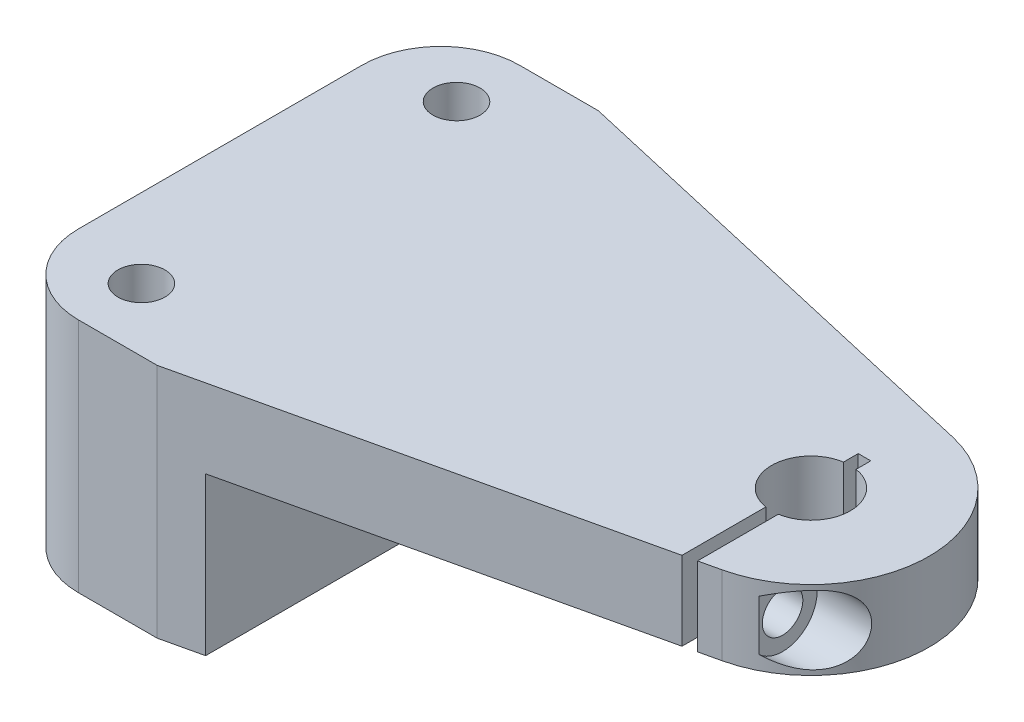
ISO-10303-21;
HEADER;
FILE_DESCRIPTION(('STEP AP214'),'2;1');
FILE_NAME('part.step','',(''),(''),'','','');
FILE_SCHEMA(('AUTOMOTIVE_DESIGN { 1 0 10303 214 1 1 1 1 }'));
ENDSEC;
DATA;
#1=APPLICATION_CONTEXT('core data for automotive mechanical design processes');
#2=APPLICATION_PROTOCOL_DEFINITION('international standard','automotive_design',2000,#1);
#3=PRODUCT_CONTEXT('',#1,'mechanical');
#4=PRODUCT('Part','Part','',(#3));
#5=PRODUCT_RELATED_PRODUCT_CATEGORY('part','',(#4));
#6=PRODUCT_DEFINITION_FORMATION('','',#4);
#7=PRODUCT_DEFINITION_CONTEXT('part definition',#1,'design');
#8=PRODUCT_DEFINITION('design','',#6,#7);
#9=PRODUCT_DEFINITION_SHAPE('','',#8);
#10=(LENGTH_UNIT() NAMED_UNIT(*) SI_UNIT(.MILLI.,.METRE.));
#11=(NAMED_UNIT(*) PLANE_ANGLE_UNIT() SI_UNIT($,.RADIAN.));
#12=(NAMED_UNIT(*) SI_UNIT($,.STERADIAN.) SOLID_ANGLE_UNIT());
#13=UNCERTAINTY_MEASURE_WITH_UNIT(LENGTH_MEASURE(1.E-05),#10,'distance_accuracy_value','');
#14=(GEOMETRIC_REPRESENTATION_CONTEXT(3) GLOBAL_UNCERTAINTY_ASSIGNED_CONTEXT((#13)) GLOBAL_UNIT_ASSIGNED_CONTEXT((#10,
#11,#12)) REPRESENTATION_CONTEXT('',''));
#15=CARTESIAN_POINT('',(0.,0.,0.));
#16=DIRECTION('',(0.,0.,1.));
#17=DIRECTION('',(1.,0.,0.));
#18=AXIS2_PLACEMENT_3D('',#15,#16,#17);
#19=CARTESIAN_POINT('',(2.12871499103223,19.05,9.28408301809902));
#20=DIRECTION('',(-0.223487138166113,0.,-0.97470687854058));
#21=DIRECTION('',(-0.97470687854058,0.,0.223487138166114));
#22=AXIS2_PLACEMENT_3D('',#19,#20,#21);
#23=PLANE('',#22);
#24=DIRECTION('',(0.97470687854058,0.,-0.223487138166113));
#25=VECTOR('',#24,1.);
#26=CARTESIAN_POINT('',(2.12871499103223,19.05,9.28408301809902));
#27=LINE('',#26,#25);
#28=CARTESIAN_POINT('',(0.508,19.05,9.65569110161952));
#29=VERTEX_POINT('',#28);
#30=CARTESIAN_POINT('',(2.12871499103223,19.05,9.28408301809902));
#31=VERTEX_POINT('',#30);
#32=EDGE_CURVE('E247',#29,#31,#27,.T.);
#33=ORIENTED_EDGE('',*,*,#32,.F.);
#34=DIRECTION('',(0.,-1.,0.));
#35=VECTOR('',#34,1.);
#36=CARTESIAN_POINT('',(0.508,19.05,9.65569110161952));
#37=LINE('',#36,#35);
#38=CARTESIAN_POINT('',(0.508000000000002,12.7,9.65569110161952));
#39=VERTEX_POINT('',#38);
#40=EDGE_CURVE('E298',#29,#39,#37,.T.);
#41=ORIENTED_EDGE('',*,*,#40,.T.);
#42=DIRECTION('',(0.97470687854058,0.,-0.223487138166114));
#43=VECTOR('',#42,1.);
#44=CARTESIAN_POINT('',(2.12871499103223,12.7,9.28408301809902));
#45=LINE('',#44,#43);
#46=CARTESIAN_POINT('',(2.12871499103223,12.7,9.28408301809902));
#47=VERTEX_POINT('',#46);
#48=EDGE_CURVE('E265',#39,#47,#45,.T.);
#49=ORIENTED_EDGE('',*,*,#48,.T.);
#50=DIRECTION('',(0.,-1.,0.));
#51=VECTOR('',#50,1.);
#52=CARTESIAN_POINT('',(2.12871499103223,19.05,9.28408301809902));
#53=LINE('',#52,#51);
#54=EDGE_CURVE('E251',#31,#47,#53,.T.);
#55=ORIENTED_EDGE('',*,*,#54,.F.);
#56=EDGE_LOOP('',(#33,#41,#49,#55));
#57=FACE_BOUND('',#56,.T.);
#58=ADVANCED_FACE('F32',(#57),#23,.F.);
#59=CARTESIAN_POINT('',(0.,19.05,0.));
#60=DIRECTION('',(0.,-1.,0.));
#61=DIRECTION('',(0.,0.,-1.));
#62=AXIS2_PLACEMENT_3D('',#59,#60,#61);
#63=CYLINDRICAL_SURFACE('',#62,3.175);
#64=DIRECTION('',(0.,-1.,0.));
#65=VECTOR('',#64,1.);
#66=CARTESIAN_POINT('',(0.508,19.05,3.13409652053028));
#67=LINE('',#66,#65);
#68=CARTESIAN_POINT('',(0.508,19.05,3.13409652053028));
#69=VERTEX_POINT('',#68);
#70=CARTESIAN_POINT('',(0.508000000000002,12.7,3.13409652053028));
#71=VERTEX_POINT('',#70);
#72=EDGE_CURVE('E291',#69,#71,#67,.T.);
#73=ORIENTED_EDGE('',*,*,#72,.F.);
#74=CARTESIAN_POINT('',(0.,19.05,0.));
#75=DIRECTION('',(0.,1.,0.));
#76=DIRECTION('',(0.,0.,1.));
#77=AXIS2_PLACEMENT_3D('',#74,#75,#76);
#78=CIRCLE('',#77,3.175);
#79=CARTESIAN_POINT('',(0.508,19.05,-3.13409652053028));
#80=VERTEX_POINT('',#79);
#81=EDGE_CURVE('E232',#69,#80,#78,.T.);
#82=ORIENTED_EDGE('',*,*,#81,.T.);
#83=DIRECTION('',(0.,-1.,0.));
#84=VECTOR('',#83,1.);
#85=CARTESIAN_POINT('',(0.508,19.05,-3.13409652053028));
#86=LINE('',#85,#84);
#87=CARTESIAN_POINT('',(0.508000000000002,12.7,-3.13409652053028));
#88=VERTEX_POINT('',#87);
#89=EDGE_CURVE('E293',#88,#80,#86,.F.);
#90=ORIENTED_EDGE('',*,*,#89,.F.);
#91=CARTESIAN_POINT('',(0.,12.7,0.));
#92=DIRECTION('',(0.,1.,0.));
#93=DIRECTION('',(0.,0.,1.));
#94=AXIS2_PLACEMENT_3D('',#91,#92,#93);
#95=CIRCLE('',#94,3.175);
#96=EDGE_CURVE('E262',#71,#88,#95,.T.);
#97=ORIENTED_EDGE('',*,*,#96,.F.);
#98=EDGE_LOOP('',(#73,#82,#90,#97));
#99=FACE_BOUND('',#98,.T.);
#100=ADVANCED_FACE('F289',(#99),#63,.F.);
#101=CARTESIAN_POINT('',(0.,19.05,0.));
#102=DIRECTION('',(0.,1.,0.));
#103=DIRECTION('',(0.,0.,1.));
#104=AXIS2_PLACEMENT_3D('',#101,#102,#103);
#105=PLANE('',#104);
#106=DIRECTION('',(-1.,0.,0.));
#107=VECTOR('',#106,1.);
#108=CARTESIAN_POINT('',(-47.625,19.05,-17.78));
#109=LINE('',#108,#107);
#110=CARTESIAN_POINT('',(-34.925,19.05,-17.78));
#111=VERTEX_POINT('',#110);
#112=CARTESIAN_POINT('',(-41.275,19.05,-17.78));
#113=VERTEX_POINT('',#112);
#114=EDGE_CURVE('E207',#111,#113,#109,.T.);
#115=ORIENTED_EDGE('',*,*,#114,.T.);
#116=CARTESIAN_POINT('',(-41.275,19.05,-11.43));
#117=DIRECTION('',(0.,1.,0.));
#118=DIRECTION('',(0.,0.,1.));
#119=AXIS2_PLACEMENT_3D('',#116,#117,#118);
#120=CIRCLE('',#119,6.35);
#121=CARTESIAN_POINT('',(-47.625,19.05,-11.43));
#122=VERTEX_POINT('',#121);
#123=EDGE_CURVE('E41',#113,#122,#120,.T.);
#124=ORIENTED_EDGE('',*,*,#123,.T.);
#125=DIRECTION('',(0.,0.,1.));
#126=VECTOR('',#125,1.);
#127=CARTESIAN_POINT('',(-47.625,19.05,-17.78));
#128=LINE('',#127,#126);
#129=CARTESIAN_POINT('',(-47.625,19.05,11.43));
#130=VERTEX_POINT('',#129);
#131=EDGE_CURVE('E206',#122,#130,#128,.T.);
#132=ORIENTED_EDGE('',*,*,#131,.T.);
#133=CARTESIAN_POINT('',(-41.275,19.05,11.43));
#134=DIRECTION('',(0.,1.,0.));
#135=DIRECTION('',(0.,0.,1.));
#136=AXIS2_PLACEMENT_3D('',#133,#134,#135);
#137=CIRCLE('',#136,6.35);
#138=CARTESIAN_POINT('',(-41.275,19.05,17.78));
#139=VERTEX_POINT('',#138);
#140=EDGE_CURVE('E48',#130,#139,#137,.T.);
#141=ORIENTED_EDGE('',*,*,#140,.T.);
#142=DIRECTION('',(1.,0.,0.));
#143=VECTOR('',#142,1.);
#144=CARTESIAN_POINT('',(-47.625,19.05,17.78));
#145=LINE('',#144,#143);
#146=CARTESIAN_POINT('',(-34.925,19.05,17.78));
#147=VERTEX_POINT('',#146);
#148=EDGE_CURVE('E215',#139,#147,#145,.T.);
#149=ORIENTED_EDGE('',*,*,#148,.T.);
#150=CARTESIAN_POINT('',(-0.508,19.05,9.88864619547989));
#151=VERTEX_POINT('',#150);
#152=EDGE_CURVE('E248',#147,#151,#27,.T.);
#153=ORIENTED_EDGE('',*,*,#152,.T.);
#154=DIRECTION('',(0.,0.,1.));
#155=VECTOR('',#154,1.);
#156=CARTESIAN_POINT('',(-0.508,19.05,-4.318));
#157=LINE('',#156,#155);
#158=CARTESIAN_POINT('',(-0.508,19.05,3.13409652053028));
#159=VERTEX_POINT('',#158);
#160=EDGE_CURVE('E348',#159,#151,#157,.T.);
#161=ORIENTED_EDGE('',*,*,#160,.F.);
#162=CARTESIAN_POINT('',(-0.508,19.05,-3.13409652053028));
#163=VERTEX_POINT('',#162);
#164=EDGE_CURVE('E334',#163,#159,#78,.T.);
#165=ORIENTED_EDGE('',*,*,#164,.F.);
#166=CARTESIAN_POINT('',(-0.508,19.05,-4.318));
#167=VERTEX_POINT('',#166);
#168=EDGE_CURVE('E347',#167,#163,#157,.T.);
#169=ORIENTED_EDGE('',*,*,#168,.F.);
#170=DIRECTION('',(-1.,0.,0.));
#171=VECTOR('',#170,1.);
#172=CARTESIAN_POINT('',(0.508,19.05,-4.318));
#173=LINE('',#172,#171);
#174=CARTESIAN_POINT('',(0.508,19.05,-4.318));
#175=VERTEX_POINT('',#174);
#176=EDGE_CURVE('E352',#175,#167,#173,.T.);
#177=ORIENTED_EDGE('',*,*,#176,.F.);
#178=DIRECTION('',(0.,0.,-1.));
#179=VECTOR('',#178,1.);
#180=CARTESIAN_POINT('',(0.508,19.05,-4.318));
#181=LINE('',#180,#179);
#182=EDGE_CURVE('E374',#80,#175,#181,.T.);
#183=ORIENTED_EDGE('',*,*,#182,.F.);
#184=ORIENTED_EDGE('',*,*,#81,.F.);
#185=EDGE_CURVE('E356',#29,#69,#181,.T.);
#186=ORIENTED_EDGE('',*,*,#185,.F.);
#187=ORIENTED_EDGE('',*,*,#32,.T.);
#188=CARTESIAN_POINT('',(0.,19.05,0.));
#189=DIRECTION('',(0.,1.,0.));
#190=DIRECTION('',(0.,0.,1.));
#191=AXIS2_PLACEMENT_3D('',#188,#189,#190);
#192=CIRCLE('',#191,9.525);
#193=CARTESIAN_POINT('',(2.12871499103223,19.05,-9.28408301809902));
#194=VERTEX_POINT('',#193);
#195=EDGE_CURVE('E240',#31,#194,#192,.T.);
#196=ORIENTED_EDGE('',*,*,#195,.T.);
#197=DIRECTION('',(-0.97470687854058,0.,-0.223487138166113));
#198=VECTOR('',#197,1.);
#199=CARTESIAN_POINT('',(-34.925,19.05,-17.78));
#200=LINE('',#199,#198);
#201=EDGE_CURVE('E243',#194,#111,#200,.T.);
#202=ORIENTED_EDGE('',*,*,#201,.T.);
#203=EDGE_LOOP('',(#115,#124,#132,#141,#149,#153,#161,#165,#169,#177,#183,#184,#186,#187,#196,#202));
#204=FACE_BOUND('',#203,.T.);
#205=CARTESIAN_POINT('',(-41.275,19.05,-12.7));
#206=DIRECTION('',(0.,1.,0.));
#207=DIRECTION('',(0.,0.,1.));
#208=AXIS2_PLACEMENT_3D('',#205,#206,#207);
#209=CIRCLE('',#208,1.89864999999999);
#210=CARTESIAN_POINT('',(-41.275,19.05,-10.80135));
#211=VERTEX_POINT('',#210);
#212=EDGE_CURVE('E326',#211,#211,#209,.T.);
#213=ORIENTED_EDGE('',*,*,#212,.F.);
#214=EDGE_LOOP('',(#213));
#215=FACE_BOUND('',#214,.T.);
#216=CARTESIAN_POINT('',(-41.275,19.05,12.7));
#217=DIRECTION('',(0.,1.,0.));
#218=DIRECTION('',(0.,0.,1.));
#219=AXIS2_PLACEMENT_3D('',#216,#217,#218);
#220=CIRCLE('',#219,1.89864999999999);
#221=CARTESIAN_POINT('',(-41.275,19.05,14.59865));
#222=VERTEX_POINT('',#221);
#223=EDGE_CURVE('E332',#222,#222,#220,.T.);
#224=ORIENTED_EDGE('',*,*,#223,.F.);
#225=EDGE_LOOP('',(#224));
#226=FACE_BOUND('',#225,.T.);
#227=ADVANCED_FACE('F204',(#204,#215,#226),#105,.T.);
#228=CARTESIAN_POINT('',(0.,0.,0.));
#229=DIRECTION('',(0.,1.,0.));
#230=DIRECTION('',(0.,0.,1.));
#231=AXIS2_PLACEMENT_3D('',#228,#229,#230);
#232=PLANE('',#231);
#233=CARTESIAN_POINT('',(-41.275,0.,-12.7));
#234=DIRECTION('',(0.,1.,0.));
#235=DIRECTION('',(0.,0.,1.));
#236=AXIS2_PLACEMENT_3D('',#233,#234,#235);
#237=CIRCLE('',#236,1.89864999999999);
#238=CARTESIAN_POINT('',(-41.275,0.,-10.80135));
#239=VERTEX_POINT('',#238);
#240=EDGE_CURVE('E323',#239,#239,#237,.T.);
#241=ORIENTED_EDGE('',*,*,#240,.T.);
#242=EDGE_LOOP('',(#241));
#243=FACE_BOUND('',#242,.T.);
#244=CARTESIAN_POINT('',(-41.275,0.,12.7));
#245=DIRECTION('',(0.,1.,0.));
#246=DIRECTION('',(0.,0.,1.));
#247=AXIS2_PLACEMENT_3D('',#244,#245,#246);
#248=CIRCLE('',#247,1.89864999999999);
#249=CARTESIAN_POINT('',(-41.275,0.,14.59865));
#250=VERTEX_POINT('',#249);
#251=EDGE_CURVE('E329',#250,#250,#248,.T.);
#252=ORIENTED_EDGE('',*,*,#251,.T.);
#253=EDGE_LOOP('',(#252));
#254=FACE_BOUND('',#253,.T.);
#255=DIRECTION('',(0.,0.,1.));
#256=VECTOR('',#255,1.);
#257=CARTESIAN_POINT('',(-47.625,0.,-17.78));
#258=LINE('',#257,#256);
#259=CARTESIAN_POINT('',(-47.625,0.,-11.43));
#260=VERTEX_POINT('',#259);
#261=CARTESIAN_POINT('',(-47.625,0.,11.43));
#262=VERTEX_POINT('',#261);
#263=EDGE_CURVE('E223',#260,#262,#258,.T.);
#264=ORIENTED_EDGE('',*,*,#263,.F.);
#265=CARTESIAN_POINT('',(-41.275,0.,-11.43));
#266=DIRECTION('',(0.,1.,0.));
#267=DIRECTION('',(0.,0.,1.));
#268=AXIS2_PLACEMENT_3D('',#265,#266,#267);
#269=CIRCLE('',#268,6.35);
#270=CARTESIAN_POINT('',(-41.275,0.,-17.78));
#271=VERTEX_POINT('',#270);
#272=EDGE_CURVE('E199',#260,#271,#269,.F.);
#273=ORIENTED_EDGE('',*,*,#272,.T.);
#274=DIRECTION('',(-1.,0.,0.));
#275=VECTOR('',#274,1.);
#276=CARTESIAN_POINT('',(-47.625,0.,-17.78));
#277=LINE('',#276,#275);
#278=CARTESIAN_POINT('',(-34.925,0.,-17.78));
#279=VERTEX_POINT('',#278);
#280=EDGE_CURVE('E222',#279,#271,#277,.T.);
#281=ORIENTED_EDGE('',*,*,#280,.F.);
#282=DIRECTION('',(-0.97470687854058,0.,-0.223487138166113));
#283=VECTOR('',#282,1.);
#284=CARTESIAN_POINT('',(-34.925,0.,-17.78));
#285=LINE('',#284,#283);
#286=CARTESIAN_POINT('',(-31.75,0.,-17.0520153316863));
#287=VERTEX_POINT('',#286);
#288=EDGE_CURVE('E228',#287,#279,#285,.T.);
#289=ORIENTED_EDGE('',*,*,#288,.F.);
#290=DIRECTION('',(0.,0.,1.));
#291=VECTOR('',#290,1.);
#292=CARTESIAN_POINT('',(-31.75,0.,0.));
#293=LINE('',#292,#291);
#294=CARTESIAN_POINT('',(-31.75,0.,17.0520153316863));
#295=VERTEX_POINT('',#294);
#296=EDGE_CURVE('E317',#287,#295,#293,.T.);
#297=ORIENTED_EDGE('',*,*,#296,.T.);
#298=DIRECTION('',(0.97470687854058,0.,-0.223487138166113));
#299=VECTOR('',#298,1.);
#300=CARTESIAN_POINT('',(2.12871499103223,0.,9.28408301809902));
#301=LINE('',#300,#299);
#302=CARTESIAN_POINT('',(-34.925,0.,17.78));
#303=VERTEX_POINT('',#302);
#304=EDGE_CURVE('E237',#303,#295,#301,.T.);
#305=ORIENTED_EDGE('',*,*,#304,.F.);
#306=DIRECTION('',(1.,0.,0.));
#307=VECTOR('',#306,1.);
#308=CARTESIAN_POINT('',(-47.625,0.,17.78));
#309=LINE('',#308,#307);
#310=CARTESIAN_POINT('',(-41.275,0.,17.78));
#311=VERTEX_POINT('',#310);
#312=EDGE_CURVE('E230',#311,#303,#309,.T.);
#313=ORIENTED_EDGE('',*,*,#312,.F.);
#314=CARTESIAN_POINT('',(-41.275,0.,11.43));
#315=DIRECTION('',(0.,1.,0.));
#316=DIRECTION('',(0.,0.,1.));
#317=AXIS2_PLACEMENT_3D('',#314,#315,#316);
#318=CIRCLE('',#317,6.35);
#319=EDGE_CURVE('E197',#311,#262,#318,.F.);
#320=ORIENTED_EDGE('',*,*,#319,.T.);
#321=EDGE_LOOP('',(#264,#273,#281,#289,#297,#305,#313,#320));
#322=FACE_BOUND('',#321,.T.);
#323=ADVANCED_FACE('F220',(#243,#254,#322),#232,.F.);
#324=CARTESIAN_POINT('',(0.,19.05,0.));
#325=DIRECTION('',(0.,-1.,0.));
#326=DIRECTION('',(0.,0.,-1.));
#327=AXIS2_PLACEMENT_3D('',#324,#325,#326);
#328=CYLINDRICAL_SURFACE('',#327,9.525);
#329=CARTESIAN_POINT('',(4.318,17.9156915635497,8.490023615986));
#330=CARTESIAN_POINT('',(4.40597686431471,17.9570382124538,8.44527816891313));
#331=CARTESIAN_POINT('',(4.49371232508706,17.9971478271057,8.3989353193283));
#332=CARTESIAN_POINT('',(4.66860369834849,18.074713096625,8.30299466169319));
#333=CARTESIAN_POINT('',(4.75575947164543,18.1121681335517,8.25339610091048));
#334=CARTESIAN_POINT('',(5.01676491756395,18.2205082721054,8.09929634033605));
#335=CARTESIAN_POINT('',(5.18952859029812,18.2870731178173,7.98980686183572));
#336=CARTESIAN_POINT('',(5.53321586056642,18.4072571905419,7.75583572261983));
#337=CARTESIAN_POINT('',(5.70407944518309,18.4606812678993,7.63116493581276));
#338=CARTESIAN_POINT('',(6.03965725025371,18.5501456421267,7.36840668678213));
#339=CARTESIAN_POINT('',(6.2043818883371,18.586216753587,7.23034353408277));
#340=CARTESIAN_POINT('',(6.45110709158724,18.6252458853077,7.00872650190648));
#341=CARTESIAN_POINT('',(6.53598098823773,18.6358021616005,6.92965311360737));
#342=CARTESIAN_POINT('',(6.70309201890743,18.650092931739,6.76813670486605));
#343=CARTESIAN_POINT('',(6.78532910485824,18.6538273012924,6.68569362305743));
#344=CARTESIAN_POINT('',(6.94639472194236,18.6536911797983,6.51817933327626));
#345=CARTESIAN_POINT('',(7.0252360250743,18.6498523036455,6.43312050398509));
#346=CARTESIAN_POINT('',(7.17936929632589,18.6338256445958,6.26064519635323));
#347=CARTESIAN_POINT('',(7.25466192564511,18.6216394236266,6.1732291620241));
#348=CARTESIAN_POINT('',(7.44913384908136,18.577101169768,5.93901227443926));
#349=CARTESIAN_POINT('',(7.56486081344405,18.5367767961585,5.79071301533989));
#350=CARTESIAN_POINT('',(7.78267131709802,18.4275181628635,5.49448780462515));
#351=CARTESIAN_POINT('',(7.88476160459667,18.3585981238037,5.34656170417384));
#352=CARTESIAN_POINT('',(8.05811069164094,18.203290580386,5.08071143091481));
#353=CARTESIAN_POINT('',(8.13169370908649,18.1213411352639,4.96172186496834));
#354=CARTESIAN_POINT('',(8.26632499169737,17.9356412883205,4.73402373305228));
#355=CARTESIAN_POINT('',(8.32737774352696,17.8318987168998,4.6253114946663));
#356=CARTESIAN_POINT('',(8.43655792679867,17.6036798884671,4.42305639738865));
#357=CARTESIAN_POINT('',(8.48462775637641,17.479115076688,4.32958184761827));
#358=CARTESIAN_POINT('',(8.56738981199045,17.2128036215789,4.16342685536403));
#359=CARTESIAN_POINT('',(8.60208446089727,17.0710600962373,4.0907426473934));
#360=CARTESIAN_POINT('',(8.65609960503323,16.7870856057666,3.97508706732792));
#361=CARTESIAN_POINT('',(8.67644215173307,16.6458346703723,3.93017778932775));
#362=CARTESIAN_POINT('',(8.70641234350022,16.3569128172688,3.8633367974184));
#363=CARTESIAN_POINT('',(8.7160426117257,16.2092434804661,3.84139945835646));
#364=CARTESIAN_POINT('',(8.72463834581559,15.917078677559,3.82183407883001));
#365=CARTESIAN_POINT('',(8.72395607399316,15.7726465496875,3.82340307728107));
#366=CARTESIAN_POINT('',(8.71276923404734,15.4861537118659,3.84882675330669));
#367=CARTESIAN_POINT('',(8.7022656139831,15.3440927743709,3.87267927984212));
#368=CARTESIAN_POINT('',(8.67131728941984,15.067051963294,3.94148205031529));
#369=CARTESIAN_POINT('',(8.65092064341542,14.9320413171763,3.98633026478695));
#370=CARTESIAN_POINT('',(8.59993560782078,14.6720533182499,4.09515837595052));
#371=CARTESIAN_POINT('',(8.56934753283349,14.5470756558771,4.15913768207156));
#372=CARTESIAN_POINT('',(8.49724863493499,14.3085481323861,4.30453739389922));
#373=CARTESIAN_POINT('',(8.45558465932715,14.195192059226,4.38619911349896));
#374=CARTESIAN_POINT('',(8.36158128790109,13.9844659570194,4.56284717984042));
#375=CARTESIAN_POINT('',(8.30924060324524,13.8870978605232,4.6578351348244));
#376=CARTESIAN_POINT('',(8.19133740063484,13.7052688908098,4.86232537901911));
#377=CARTESIAN_POINT('',(8.12523967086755,13.6217109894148,4.97231901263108));
#378=CARTESIAN_POINT('',(7.98250538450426,13.4741714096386,5.19837660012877));
#379=CARTESIAN_POINT('',(7.9058642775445,13.4101982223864,5.31444316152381));
#380=CARTESIAN_POINT('',(7.73369313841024,13.2947801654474,5.56245965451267));
#381=CARTESIAN_POINT('',(7.63700248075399,13.24567010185,5.69468186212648));
#382=CARTESIAN_POINT('',(7.43371841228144,13.168995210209,5.95760854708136));
#383=CARTESIAN_POINT('',(7.32712404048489,13.1414324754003,6.08831287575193));
#384=CARTESIAN_POINT('',(7.13014270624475,13.1092494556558,6.31698023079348));
#385=CARTESIAN_POINT('',(7.04133954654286,13.1009193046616,6.41582810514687));
#386=CARTESIAN_POINT('',(6.85946335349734,13.0945497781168,6.60992249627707));
#387=CARTESIAN_POINT('',(6.76638837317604,13.0965151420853,6.7051673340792));
#388=CARTESIAN_POINT('',(6.5761913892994,13.1095947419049,6.89182004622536));
#389=CARTESIAN_POINT('',(6.47905120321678,13.1207554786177,6.98320593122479));
#390=CARTESIAN_POINT('',(6.28172407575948,13.1511870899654,7.16123164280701));
#391=CARTESIAN_POINT('',(6.18153625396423,13.1704603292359,7.24787007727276));
#392=CARTESIAN_POINT('',(5.93922494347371,13.2250066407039,7.44880493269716));
#393=CARTESIAN_POINT('',(5.79591826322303,13.2635863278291,7.5607840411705));
#394=CARTESIAN_POINT('',(5.50543839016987,13.3522945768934,7.7748554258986));
#395=CARTESIAN_POINT('',(5.35826208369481,13.4024327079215,7.87693941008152));
#396=CARTESIAN_POINT('',(5.06317831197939,13.511685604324,8.06972440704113));
#397=CARTESIAN_POINT('',(4.91531229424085,13.5706598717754,8.16056884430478));
#398=CARTESIAN_POINT('',(4.69215174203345,13.6651927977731,8.28955403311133));
#399=CARTESIAN_POINT('',(4.61760532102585,13.6976838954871,8.33130138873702));
#400=CARTESIAN_POINT('',(4.46809742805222,13.7645848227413,8.41242894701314));
#401=CARTESIAN_POINT('',(4.39313599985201,13.7989944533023,8.4518093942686));
#402=CARTESIAN_POINT('',(4.318,13.8343084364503,8.490023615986));
#403=B_SPLINE_CURVE_WITH_KNOTS('',3,(#329,#330,#331,#332,#333,#334,#335,#336,#337,#338,#339,
#340,#341,#342,#343,#344,#345,#346,#347,#348,#349,#350,#351,#352,#353,#354,#355,#356,#357,#358,
#359,#360,#361,#362,#363,#364,#365,#366,#367,#368,#369,#370,#371,#372,#373,#374,#375,#376,#377,
#378,#379,#380,#381,#382,#383,#384,#385,#386,#387,#388,#389,#390,#391,#392,#393,#394,#395,#396,
#397,#398,#399,#400,#401,#402),.UNSPECIFIED.,.F.,.F.,(4,2,2,2,2,2,2,2,2,2,2,2,2,2,2,2,2,2,2,2,2,
2,2,2,2,2,2,2,2,2,2,2,2,2,2,2,4),(0.,0.320996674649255,0.642067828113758,1.28648123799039,
1.9399540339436,2.59226210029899,2.94147131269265,3.29068688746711,3.63844772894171,
3.98614351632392,4.56091573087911,5.13540245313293,5.61974093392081,6.10390568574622,
6.59018452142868,7.07637522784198,7.52296597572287,7.96944734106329,8.40071302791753,
8.83193708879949,9.2610870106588,9.69022368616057,10.1256343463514,10.5610975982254,
11.018606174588,11.4763128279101,11.9874589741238,12.4986547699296,12.8975497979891,
13.2966284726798,13.6977377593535,14.0989640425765,14.6559240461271,15.2133468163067,
15.7626979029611,16.0368829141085,16.3110395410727),.UNSPECIFIED.);
#404=CARTESIAN_POINT('',(4.318,17.9156915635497,8.490023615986));
#405=VERTEX_POINT('',#404);
#406=CARTESIAN_POINT('',(4.318,13.8343084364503,8.490023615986));
#407=VERTEX_POINT('',#406);
#408=EDGE_CURVE('E169',#405,#407,#403,.T.);
#409=ORIENTED_EDGE('',*,*,#408,.T.);
#410=DIRECTION('',(0.,-1.,0.));
#411=VECTOR('',#410,1.);
#412=CARTESIAN_POINT('',(4.318,19.05,8.490023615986));
#413=LINE('',#412,#411);
#414=EDGE_CURVE('E176',#407,#405,#413,.F.);
#415=ORIENTED_EDGE('',*,*,#414,.T.);
#416=EDGE_LOOP('',(#409,#415));
#417=FACE_BOUND('',#416,.T.);
#418=ORIENTED_EDGE('',*,*,#54,.T.);
#419=CARTESIAN_POINT('',(0.,12.7,0.));
#420=DIRECTION('',(0.,1.,0.));
#421=DIRECTION('',(0.,0.,1.));
#422=AXIS2_PLACEMENT_3D('',#419,#420,#421);
#423=CIRCLE('',#422,9.525);
#424=CARTESIAN_POINT('',(2.12871499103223,12.7,-9.28408301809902));
#425=VERTEX_POINT('',#424);
#426=EDGE_CURVE('E311',#47,#425,#423,.T.);
#427=ORIENTED_EDGE('',*,*,#426,.T.);
#428=DIRECTION('',(0.,-1.,0.));
#429=VECTOR('',#428,1.);
#430=CARTESIAN_POINT('',(2.12871499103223,19.05,-9.28408301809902));
#431=LINE('',#430,#429);
#432=EDGE_CURVE('E258',#194,#425,#431,.T.);
#433=ORIENTED_EDGE('',*,*,#432,.F.);
#434=ORIENTED_EDGE('',*,*,#195,.F.);
#435=EDGE_LOOP('',(#418,#427,#433,#434));
#436=FACE_BOUND('',#435,.T.);
#437=ADVANCED_FACE('F34',(#417,#436),#328,.T.);
#438=CARTESIAN_POINT('',(-34.925,19.05,-17.78));
#439=DIRECTION('',(-0.223487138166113,0.,0.97470687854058));
#440=DIRECTION('',(0.97470687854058,0.,0.223487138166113));
#441=AXIS2_PLACEMENT_3D('',#438,#439,#440);
#442=PLANE('',#441);
#443=DIRECTION('',(-0.97470687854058,0.,-0.223487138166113));
#444=VECTOR('',#443,1.);
#445=CARTESIAN_POINT('',(-34.925,12.7,-17.78));
#446=LINE('',#445,#444);
#447=CARTESIAN_POINT('',(-31.75,12.7,-17.0520153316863));
#448=VERTEX_POINT('',#447);
#449=EDGE_CURVE('E314',#425,#448,#446,.T.);
#450=ORIENTED_EDGE('',*,*,#449,.T.);
#451=DIRECTION('',(0.,-1.,0.));
#452=VECTOR('',#451,1.);
#453=CARTESIAN_POINT('',(-31.75,19.05,-17.0520153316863));
#454=LINE('',#453,#452);
#455=EDGE_CURVE('E320',#448,#287,#454,.T.);
#456=ORIENTED_EDGE('',*,*,#455,.T.);
#457=ORIENTED_EDGE('',*,*,#288,.T.);
#458=DIRECTION('',(0.,-1.,0.));
#459=VECTOR('',#458,1.);
#460=CARTESIAN_POINT('',(-34.925,19.05,-17.78));
#461=LINE('',#460,#459);
#462=EDGE_CURVE('E227',#111,#279,#461,.T.);
#463=ORIENTED_EDGE('',*,*,#462,.F.);
#464=ORIENTED_EDGE('',*,*,#201,.F.);
#465=ORIENTED_EDGE('',*,*,#432,.T.);
#466=EDGE_LOOP('',(#450,#456,#457,#463,#464,#465));
#467=FACE_BOUND('',#466,.T.);
#468=ADVANCED_FACE('F428',(#467),#442,.F.);
#469=CARTESIAN_POINT('',(-47.625,19.05,-17.78));
#470=DIRECTION('',(0.,0.,1.));
#471=DIRECTION('',(1.,0.,0.));
#472=AXIS2_PLACEMENT_3D('',#469,#470,#471);
#473=PLANE('',#472);
#474=ORIENTED_EDGE('',*,*,#280,.T.);
#475=DIRECTION('',(0.,-1.,0.));
#476=VECTOR('',#475,1.);
#477=CARTESIAN_POINT('',(-41.275,19.05,-17.78));
#478=LINE('',#477,#476);
#479=EDGE_CURVE('E56',#271,#113,#478,.F.);
#480=ORIENTED_EDGE('',*,*,#479,.T.);
#481=ORIENTED_EDGE('',*,*,#114,.F.);
#482=ORIENTED_EDGE('',*,*,#462,.T.);
#483=EDGE_LOOP('',(#474,#480,#481,#482));
#484=FACE_BOUND('',#483,.T.);
#485=ADVANCED_FACE('F225',(#484),#473,.F.);
#486=CARTESIAN_POINT('',(-47.625,19.05,-17.78));
#487=DIRECTION('',(1.,0.,0.));
#488=DIRECTION('',(0.,0.,-1.));
#489=AXIS2_PLACEMENT_3D('',#486,#487,#488);
#490=PLANE('',#489);
#491=ORIENTED_EDGE('',*,*,#131,.F.);
#492=DIRECTION('',(0.,-1.,0.));
#493=VECTOR('',#492,1.);
#494=CARTESIAN_POINT('',(-47.625,19.05,-11.43));
#495=LINE('',#494,#493);
#496=EDGE_CURVE('E187',#122,#260,#495,.T.);
#497=ORIENTED_EDGE('',*,*,#496,.T.);
#498=ORIENTED_EDGE('',*,*,#263,.T.);
#499=DIRECTION('',(0.,-1.,0.));
#500=VECTOR('',#499,1.);
#501=CARTESIAN_POINT('',(-47.625,19.05,11.43));
#502=LINE('',#501,#500);
#503=EDGE_CURVE('E185',#262,#130,#502,.F.);
#504=ORIENTED_EDGE('',*,*,#503,.T.);
#505=EDGE_LOOP('',(#491,#497,#498,#504));
#506=FACE_BOUND('',#505,.T.);
#507=ADVANCED_FACE('F211',(#506),#490,.F.);
#508=CARTESIAN_POINT('',(-47.625,19.05,17.78));
#509=DIRECTION('',(0.,0.,-1.));
#510=DIRECTION('',(-1.,0.,0.));
#511=AXIS2_PLACEMENT_3D('',#508,#509,#510);
#512=PLANE('',#511);
#513=ORIENTED_EDGE('',*,*,#148,.F.);
#514=DIRECTION('',(0.,-1.,0.));
#515=VECTOR('',#514,1.);
#516=CARTESIAN_POINT('',(-41.275,19.05,17.78));
#517=LINE('',#516,#515);
#518=EDGE_CURVE('E12',#139,#311,#517,.T.);
#519=ORIENTED_EDGE('',*,*,#518,.T.);
#520=ORIENTED_EDGE('',*,*,#312,.T.);
#521=DIRECTION('',(0.,-1.,0.));
#522=VECTOR('',#521,1.);
#523=CARTESIAN_POINT('',(-34.925,19.05,17.78));
#524=LINE('',#523,#522);
#525=EDGE_CURVE('E254',#147,#303,#524,.T.);
#526=ORIENTED_EDGE('',*,*,#525,.F.);
#527=EDGE_LOOP('',(#513,#519,#520,#526));
#528=FACE_BOUND('',#527,.T.);
#529=ADVANCED_FACE('F414',(#528),#512,.F.);
#530=CARTESIAN_POINT('',(-31.75,12.7,17.0520153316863));
#531=VERTEX_POINT('',#530);
#532=CARTESIAN_POINT('',(-0.508000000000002,12.7,9.88864619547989));
#533=VERTEX_POINT('',#532);
#534=EDGE_CURVE('E308',#531,#533,#45,.T.);
#535=ORIENTED_EDGE('',*,*,#534,.T.);
#536=DIRECTION('',(0.,1.,0.));
#537=VECTOR('',#536,1.);
#538=CARTESIAN_POINT('',(-0.508,19.05,9.88864619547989));
#539=LINE('',#538,#537);
#540=EDGE_CURVE('E300',#533,#151,#539,.T.);
#541=ORIENTED_EDGE('',*,*,#540,.T.);
#542=ORIENTED_EDGE('',*,*,#152,.F.);
#543=ORIENTED_EDGE('',*,*,#525,.T.);
#544=ORIENTED_EDGE('',*,*,#304,.T.);
#545=DIRECTION('',(0.,1.,0.));
#546=VECTOR('',#545,1.);
#547=CARTESIAN_POINT('',(-31.75,19.05,17.0520153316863));
#548=LINE('',#547,#546);
#549=EDGE_CURVE('E261',#295,#531,#548,.T.);
#550=ORIENTED_EDGE('',*,*,#549,.T.);
#551=EDGE_LOOP('',(#535,#541,#542,#543,#544,#550));
#552=FACE_BOUND('',#551,.T.);
#553=ADVANCED_FACE('F365',(#552),#23,.F.);
#554=DIRECTION('',(0.,-1.,0.));
#555=VECTOR('',#554,1.);
#556=CARTESIAN_POINT('',(-0.508,19.05,-3.13409652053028));
#557=LINE('',#556,#555);
#558=CARTESIAN_POINT('',(-0.508000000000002,12.7,-3.13409652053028));
#559=VERTEX_POINT('',#558);
#560=EDGE_CURVE('E296',#163,#559,#557,.T.);
#561=ORIENTED_EDGE('',*,*,#560,.F.);
#562=ORIENTED_EDGE('',*,*,#164,.T.);
#563=DIRECTION('',(0.,-1.,0.));
#564=VECTOR('',#563,1.);
#565=CARTESIAN_POINT('',(-0.508,19.05,3.13409652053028));
#566=LINE('',#565,#564);
#567=CARTESIAN_POINT('',(-0.508000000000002,12.7,3.13409652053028));
#568=VERTEX_POINT('',#567);
#569=EDGE_CURVE('E342',#568,#159,#566,.F.);
#570=ORIENTED_EDGE('',*,*,#569,.F.);
#571=EDGE_CURVE('E266',#559,#568,#95,.T.);
#572=ORIENTED_EDGE('',*,*,#571,.F.);
#573=EDGE_LOOP('',(#561,#562,#570,#572));
#574=FACE_BOUND('',#573,.T.);
#575=ADVANCED_FACE('F340',(#574),#63,.F.);
#576=CARTESIAN_POINT('',(-41.275,19.05,12.7));
#577=DIRECTION('',(0.,1.,0.));
#578=DIRECTION('',(0.,0.,1.));
#579=AXIS2_PLACEMENT_3D('',#576,#577,#578);
#580=CYLINDRICAL_SURFACE('',#579,1.89864999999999);
#581=ORIENTED_EDGE('',*,*,#251,.F.);
#582=EDGE_LOOP('',(#581));
#583=FACE_BOUND('',#582,.T.);
#584=ORIENTED_EDGE('',*,*,#223,.T.);
#585=EDGE_LOOP('',(#584));
#586=FACE_BOUND('',#585,.T.);
#587=ADVANCED_FACE('F418',(#583,#586),#580,.F.);
#588=CARTESIAN_POINT('',(-41.275,19.05,-12.7));
#589=DIRECTION('',(0.,1.,0.));
#590=DIRECTION('',(0.,0.,1.));
#591=AXIS2_PLACEMENT_3D('',#588,#589,#590);
#592=CYLINDRICAL_SURFACE('',#591,1.89864999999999);
#593=ORIENTED_EDGE('',*,*,#240,.F.);
#594=EDGE_LOOP('',(#593));
#595=FACE_BOUND('',#594,.T.);
#596=ORIENTED_EDGE('',*,*,#212,.T.);
#597=EDGE_LOOP('',(#596));
#598=FACE_BOUND('',#597,.T.);
#599=ADVANCED_FACE('F484',(#595,#598),#592,.F.);
#600=CARTESIAN_POINT('',(-31.75,12.7,-17.78));
#601=DIRECTION('',(-1.,0.,0.));
#602=DIRECTION('',(0.,-1.,0.));
#603=AXIS2_PLACEMENT_3D('',#600,#601,#602);
#604=PLANE('',#603);
#605=DIRECTION('',(0.,0.,1.));
#606=VECTOR('',#605,1.);
#607=CARTESIAN_POINT('',(-31.75,12.7,-17.78));
#608=LINE('',#607,#606);
#609=EDGE_CURVE('E305',#448,#531,#608,.T.);
#610=ORIENTED_EDGE('',*,*,#609,.T.);
#611=ORIENTED_EDGE('',*,*,#549,.F.);
#612=ORIENTED_EDGE('',*,*,#296,.F.);
#613=ORIENTED_EDGE('',*,*,#455,.F.);
#614=EDGE_LOOP('',(#610,#611,#612,#613));
#615=FACE_BOUND('',#614,.T.);
#616=ADVANCED_FACE('F481',(#615),#604,.F.);
#617=CARTESIAN_POINT('',(-31.75,12.7,-17.78));
#618=DIRECTION('',(0.,1.,0.));
#619=DIRECTION('',(0.,0.,1.));
#620=AXIS2_PLACEMENT_3D('',#617,#618,#619);
#621=PLANE('',#620);
#622=ORIENTED_EDGE('',*,*,#48,.F.);
#623=DIRECTION('',(0.,0.,-1.));
#624=VECTOR('',#623,1.);
#625=CARTESIAN_POINT('',(0.508000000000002,12.7,-17.78));
#626=LINE('',#625,#624);
#627=EDGE_CURVE('E177',#39,#71,#626,.T.);
#628=ORIENTED_EDGE('',*,*,#627,.T.);
#629=ORIENTED_EDGE('',*,*,#96,.T.);
#630=CARTESIAN_POINT('',(0.508,12.7,-4.318));
#631=VERTEX_POINT('',#630);
#632=EDGE_CURVE('E274',#88,#631,#626,.T.);
#633=ORIENTED_EDGE('',*,*,#632,.T.);
#634=DIRECTION('',(-1.,0.,0.));
#635=VECTOR('',#634,1.);
#636=CARTESIAN_POINT('',(-31.75,12.7,-4.318));
#637=LINE('',#636,#635);
#638=CARTESIAN_POINT('',(-0.507999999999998,12.7,-4.318));
#639=VERTEX_POINT('',#638);
#640=EDGE_CURVE('E269',#631,#639,#637,.T.);
#641=ORIENTED_EDGE('',*,*,#640,.T.);
#642=DIRECTION('',(0.,0.,1.));
#643=VECTOR('',#642,1.);
#644=CARTESIAN_POINT('',(-0.508000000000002,12.7,-17.78));
#645=LINE('',#644,#643);
#646=EDGE_CURVE('E272',#639,#559,#645,.T.);
#647=ORIENTED_EDGE('',*,*,#646,.T.);
#648=ORIENTED_EDGE('',*,*,#571,.T.);
#649=EDGE_CURVE('E275',#568,#533,#645,.T.);
#650=ORIENTED_EDGE('',*,*,#649,.T.);
#651=ORIENTED_EDGE('',*,*,#534,.F.);
#652=ORIENTED_EDGE('',*,*,#609,.F.);
#653=ORIENTED_EDGE('',*,*,#449,.F.);
#654=ORIENTED_EDGE('',*,*,#426,.F.);
#655=EDGE_LOOP('',(#622,#628,#629,#633,#641,#647,#648,#650,#651,#652,#653,#654));
#656=FACE_BOUND('',#655,.T.);
#657=ADVANCED_FACE('F282',(#656),#621,.F.);
#658=CARTESIAN_POINT('',(0.508,0.,-4.318));
#659=DIRECTION('',(0.,0.,-1.));
#660=DIRECTION('',(-1.,0.,0.));
#661=AXIS2_PLACEMENT_3D('',#658,#659,#660);
#662=PLANE('',#661);
#663=DIRECTION('',(0.,1.,0.));
#664=VECTOR('',#663,1.);
#665=CARTESIAN_POINT('',(0.508,0.,-4.318));
#666=LINE('',#665,#664);
#667=EDGE_CURVE('E354',#631,#175,#666,.T.);
#668=ORIENTED_EDGE('',*,*,#667,.T.);
#669=ORIENTED_EDGE('',*,*,#176,.T.);
#670=DIRECTION('',(0.,1.,0.));
#671=VECTOR('',#670,1.);
#672=CARTESIAN_POINT('',(-0.508,0.,-4.318));
#673=LINE('',#672,#671);
#674=EDGE_CURVE('E360',#639,#167,#673,.T.);
#675=ORIENTED_EDGE('',*,*,#674,.F.);
#676=ORIENTED_EDGE('',*,*,#640,.F.);
#677=EDGE_LOOP('',(#668,#669,#675,#676));
#678=FACE_BOUND('',#677,.T.);
#679=ADVANCED_FACE('F372',(#678),#662,.F.);
#680=CARTESIAN_POINT('',(-0.508,0.,-4.318));
#681=DIRECTION('',(-1.,0.,0.));
#682=DIRECTION('',(0.,0.,1.));
#683=AXIS2_PLACEMENT_3D('',#680,#681,#682);
#684=PLANE('',#683);
#685=ORIENTED_EDGE('',*,*,#560,.T.);
#686=ORIENTED_EDGE('',*,*,#646,.F.);
#687=ORIENTED_EDGE('',*,*,#674,.T.);
#688=ORIENTED_EDGE('',*,*,#168,.T.);
#689=EDGE_LOOP('',(#685,#686,#687,#688));
#690=FACE_BOUND('',#689,.T.);
#691=ADVANCED_FACE('F370',(#690),#684,.F.);
#692=CARTESIAN_POINT('',(0.508,0.,-4.318));
#693=DIRECTION('',(1.,0.,0.));
#694=DIRECTION('',(0.,0.,-1.));
#695=AXIS2_PLACEMENT_3D('',#692,#693,#694);
#696=PLANE('',#695);
#697=ORIENTED_EDGE('',*,*,#89,.T.);
#698=ORIENTED_EDGE('',*,*,#182,.T.);
#699=ORIENTED_EDGE('',*,*,#667,.F.);
#700=ORIENTED_EDGE('',*,*,#632,.F.);
#701=EDGE_LOOP('',(#697,#698,#699,#700));
#702=FACE_BOUND('',#701,.T.);
#703=ADVANCED_FACE('F459',(#702),#696,.F.);
#704=CARTESIAN_POINT('',(-0.508,15.875,6.604));
#705=DIRECTION('',(1.,0.,0.));
#706=DIRECTION('',(0.,0.,-1.));
#707=AXIS2_PLACEMENT_3D('',#704,#705,#706);
#708=CIRCLE('',#707,1.1303);
#709=CARTESIAN_POINT('',(-0.508,15.875,5.4737));
#710=VERTEX_POINT('',#709);
#711=EDGE_CURVE('E376',#710,#710,#708,.T.);
#712=ORIENTED_EDGE('',*,*,#711,.F.);
#713=EDGE_LOOP('',(#712));
#714=FACE_BOUND('',#713,.T.);
#715=ORIENTED_EDGE('',*,*,#649,.F.);
#716=ORIENTED_EDGE('',*,*,#569,.T.);
#717=ORIENTED_EDGE('',*,*,#160,.T.);
#718=ORIENTED_EDGE('',*,*,#540,.F.);
#719=EDGE_LOOP('',(#715,#716,#717,#718));
#720=FACE_BOUND('',#719,.T.);
#721=ADVANCED_FACE('F366',(#714,#720),#684,.F.);
#722=CARTESIAN_POINT('',(0.508,15.875,6.604));
#723=DIRECTION('',(1.,0.,0.));
#724=DIRECTION('',(0.,0.,-1.));
#725=AXIS2_PLACEMENT_3D('',#722,#723,#724);
#726=CIRCLE('',#725,1.63195);
#727=CARTESIAN_POINT('',(0.508,15.875,4.97205));
#728=VERTEX_POINT('',#727);
#729=EDGE_CURVE('E181',#728,#728,#726,.T.);
#730=ORIENTED_EDGE('',*,*,#729,.T.);
#731=EDGE_LOOP('',(#730));
#732=FACE_BOUND('',#731,.T.);
#733=ORIENTED_EDGE('',*,*,#185,.T.);
#734=ORIENTED_EDGE('',*,*,#72,.T.);
#735=ORIENTED_EDGE('',*,*,#627,.F.);
#736=ORIENTED_EDGE('',*,*,#40,.F.);
#737=EDGE_LOOP('',(#733,#734,#735,#736));
#738=FACE_BOUND('',#737,.T.);
#739=ADVANCED_FACE('F438',(#732,#738),#696,.F.);
#740=CARTESIAN_POINT('',(-0.508,15.875,6.604));
#741=DIRECTION('',(1.,0.,0.));
#742=DIRECTION('',(0.,0.,-1.));
#743=AXIS2_PLACEMENT_3D('',#740,#741,#742);
#744=CYLINDRICAL_SURFACE('',#743,1.1303);
#745=CARTESIAN_POINT('',(-8.1026,15.875,6.604));
#746=DIRECTION('',(1.,0.,0.));
#747=DIRECTION('',(0.,0.,-1.));
#748=AXIS2_PLACEMENT_3D('',#745,#746,#747);
#749=CIRCLE('',#748,1.1303);
#750=CARTESIAN_POINT('',(-8.1026,15.875,5.4737));
#751=VERTEX_POINT('',#750);
#752=EDGE_CURVE('E378',#751,#751,#749,.T.);
#753=ORIENTED_EDGE('',*,*,#752,.F.);
#754=EDGE_LOOP('',(#753));
#755=FACE_BOUND('',#754,.T.);
#756=ORIENTED_EDGE('',*,*,#711,.T.);
#757=EDGE_LOOP('',(#756));
#758=FACE_BOUND('',#757,.T.);
#759=ADVANCED_FACE('F398',(#755,#758),#744,.F.);
#760=CARTESIAN_POINT('',(-8.1026,15.875,6.604));
#761=DIRECTION('',(1.,0.,0.));
#762=DIRECTION('',(0.,0.,-1.));
#763=AXIS2_PLACEMENT_3D('',#760,#761,#762);
#764=CONICAL_SURFACE('',#763,1.1303,1.02974425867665);
#765=CARTESIAN_POINT('',(-8.78175275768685,15.875,6.604));
#766=VERTEX_POINT('',#765);
#767=VERTEX_LOOP('',#766);
#768=FACE_BOUND('',#767,.T.);
#769=ORIENTED_EDGE('',*,*,#752,.T.);
#770=EDGE_LOOP('',(#769));
#771=FACE_BOUND('',#770,.T.);
#772=ADVANCED_FACE('F391',(#768,#771),#764,.F.);
#773=CARTESIAN_POINT('',(4.318,17.50695,6.604));
#774=DIRECTION('',(-1.,0.,0.));
#775=DIRECTION('',(0.,0.,1.));
#776=AXIS2_PLACEMENT_3D('',#773,#774,#775);
#777=PLANE('',#776);
#778=CARTESIAN_POINT('',(4.318,15.875,6.604));
#779=DIRECTION('',(1.,0.,0.));
#780=DIRECTION('',(0.,0.,-1.));
#781=AXIS2_PLACEMENT_3D('',#778,#779,#780);
#782=CIRCLE('',#781,1.63195);
#783=CARTESIAN_POINT('',(4.318,15.875,4.97205));
#784=VERTEX_POINT('',#783);
#785=EDGE_CURVE('E182',#784,#784,#782,.T.);
#786=ORIENTED_EDGE('',*,*,#785,.F.);
#787=EDGE_LOOP('',(#786));
#788=FACE_BOUND('',#787,.T.);
#789=CARTESIAN_POINT('',(4.318,15.875,6.604));
#790=DIRECTION('',(1.,0.,0.));
#791=DIRECTION('',(0.,0.,-1.));
#792=AXIS2_PLACEMENT_3D('',#789,#790,#791);
#793=CIRCLE('',#792,2.77876);
#794=EDGE_CURVE('E172',#407,#405,#793,.T.);
#795=ORIENTED_EDGE('',*,*,#794,.T.);
#796=ORIENTED_EDGE('',*,*,#414,.F.);
#797=EDGE_LOOP('',(#795,#796));
#798=FACE_BOUND('',#797,.T.);
#799=ADVANCED_FACE('F180',(#788,#798),#777,.F.);
#800=CARTESIAN_POINT('',(9.398,15.875,6.604));
#801=DIRECTION('',(1.,0.,0.));
#802=DIRECTION('',(0.,0.,-1.));
#803=AXIS2_PLACEMENT_3D('',#800,#801,#802);
#804=CYLINDRICAL_SURFACE('',#803,2.77876);
#805=ORIENTED_EDGE('',*,*,#794,.F.);
#806=ORIENTED_EDGE('',*,*,#408,.F.);
#807=EDGE_LOOP('',(#805,#806));
#808=FACE_BOUND('',#807,.T.);
#809=ADVANCED_FACE('F171',(#808),#804,.F.);
#810=CARTESIAN_POINT('',(9.398,15.875,6.604));
#811=DIRECTION('',(1.,0.,0.));
#812=DIRECTION('',(0.,0.,-1.));
#813=AXIS2_PLACEMENT_3D('',#810,#811,#812);
#814=CYLINDRICAL_SURFACE('',#813,1.63195);
#815=ORIENTED_EDGE('',*,*,#729,.F.);
#816=EDGE_LOOP('',(#815));
#817=FACE_BOUND('',#816,.T.);
#818=ORIENTED_EDGE('',*,*,#785,.T.);
#819=EDGE_LOOP('',(#818));
#820=FACE_BOUND('',#819,.T.);
#821=ADVANCED_FACE('F388',(#817,#820),#814,.F.);
#822=CARTESIAN_POINT('',(-41.275,19.05,-11.43));
#823=DIRECTION('',(0.,-1.,0.));
#824=DIRECTION('',(0.,0.,-1.));
#825=AXIS2_PLACEMENT_3D('',#822,#823,#824);
#826=CYLINDRICAL_SURFACE('',#825,6.35);
#827=ORIENTED_EDGE('',*,*,#123,.F.);
#828=ORIENTED_EDGE('',*,*,#479,.F.);
#829=ORIENTED_EDGE('',*,*,#272,.F.);
#830=ORIENTED_EDGE('',*,*,#496,.F.);
#831=EDGE_LOOP('',(#827,#828,#829,#830));
#832=FACE_BOUND('',#831,.T.);
#833=ADVANCED_FACE('F217',(#832),#826,.T.);
#834=CARTESIAN_POINT('',(-41.275,19.05,11.43));
#835=DIRECTION('',(0.,-1.,0.));
#836=DIRECTION('',(0.,0.,-1.));
#837=AXIS2_PLACEMENT_3D('',#834,#835,#836);
#838=CYLINDRICAL_SURFACE('',#837,6.35);
#839=ORIENTED_EDGE('',*,*,#140,.F.);
#840=ORIENTED_EDGE('',*,*,#503,.F.);
#841=ORIENTED_EDGE('',*,*,#319,.F.);
#842=ORIENTED_EDGE('',*,*,#518,.F.);
#843=EDGE_LOOP('',(#839,#840,#841,#842));
#844=FACE_BOUND('',#843,.T.);
#845=ADVANCED_FACE('F445',(#844),#838,.T.);
#846=CLOSED_SHELL('',(#58,#100,#227,#323,#437,#468,#485,#507,#529,#553,#575,#587,#599,#616,#657,
#679,#691,#703,#721,#739,#759,#772,#799,#809,#821,#833,#845));
#847=MANIFOLD_SOLID_BREP('B2',#846);
#848=ADVANCED_BREP_SHAPE_REPRESENTATION('',(#18,#847),#14);
#849=SHAPE_DEFINITION_REPRESENTATION(#9,#848);
ENDSEC;
END-ISO-10303-21;
